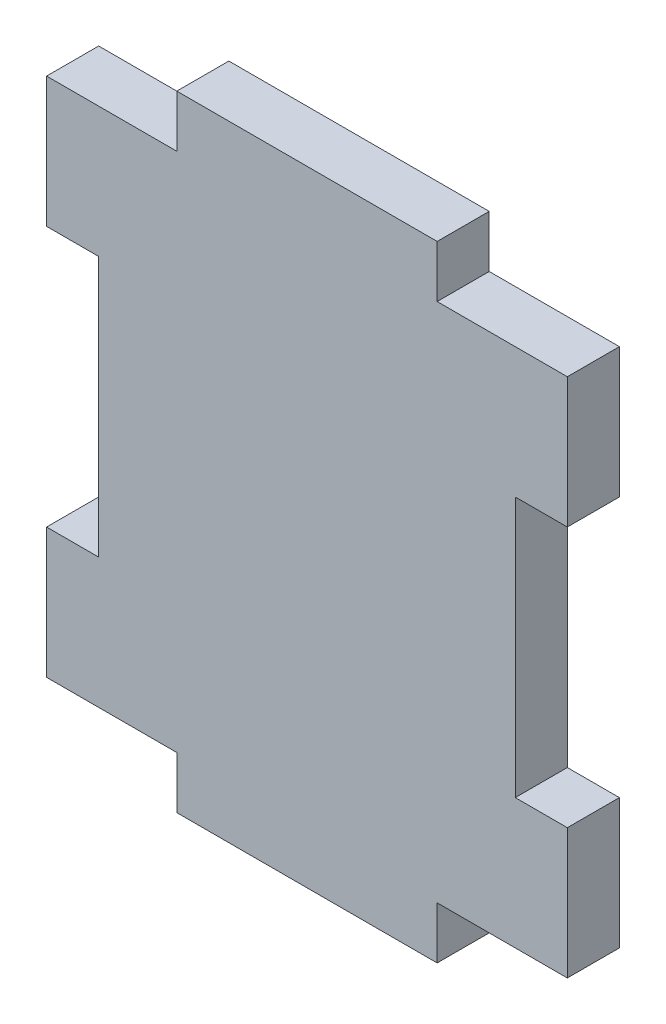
from build123d import *

# Parameters (mm, degrees)
SALIENTE_EXTRUIR1_DEPTH = 3


with BuildPart() as part:
    # Croquis1 → Saliente-Extruir1 (new body)
    with BuildSketch(Plane.XY):
        Polygon((0, 25.5), (0, 33), (7.5, 33), (7.5, 36), (22.5, 36), (22.5, 33), (30, 33), (30, 25.5), (27, 25.5), (27, 10.5), (30, 10.5), (30, 3), (22.5, 3), (22.5, 0), (7.5, 0), (7.5, 3), (0, 3), (0, 10.5), (3, 10.5), (3, 25.5), align=None)
    extrude(amount=SALIENTE_EXTRUIR1_DEPTH)


solid = part.part
